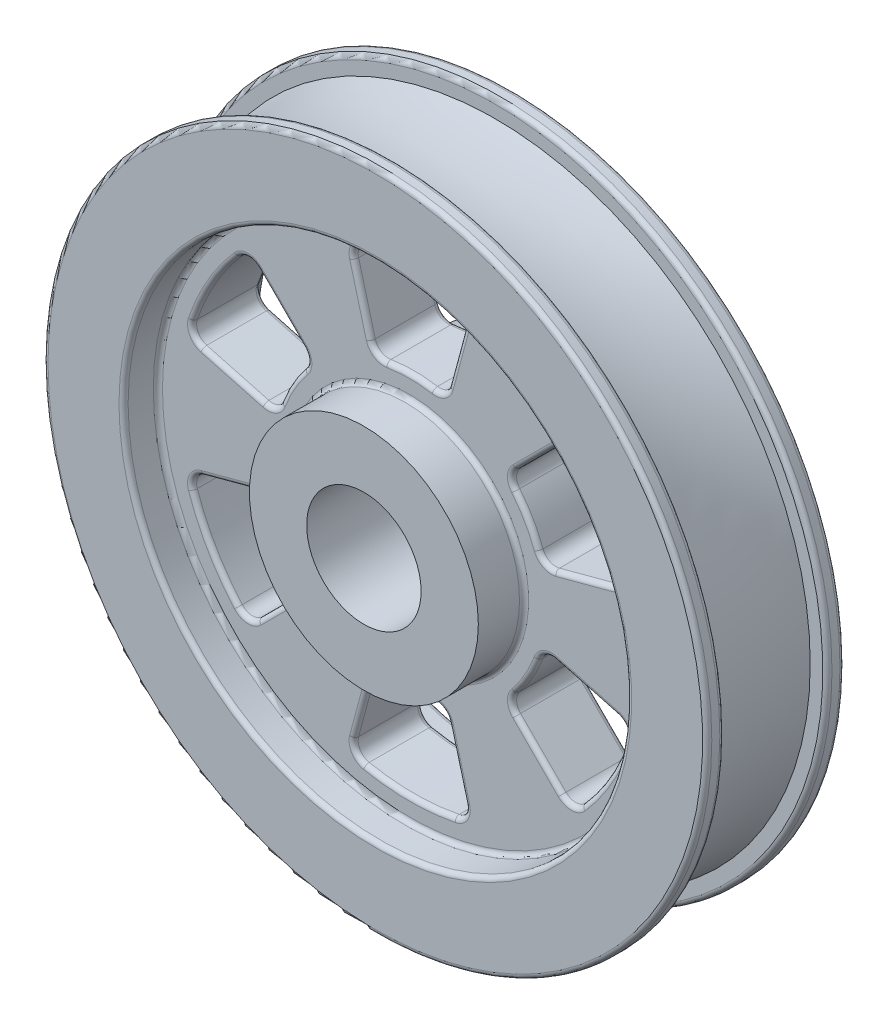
from build123d import *

# Parameters (mm, degrees)
SPOKE_HOLE_DEPTH             = 269.057260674
SPOKE_HOLE_PATTERN_COUNT     = 6
F_0_10_INCH_FILLETS_ROUNDS_R = 2.54


with BuildPart() as part:
    # Wheel Cross-section → Revolve1 (revolve)
    with BuildSketch(Plane(origin=(0, 0, 0), x_dir=(0, 0, -1), z_dir=(1, 0, 0)), mode=Mode.PRIVATE) as revolve1_sk:
        with BuildLine():
            Line((44.45, 31.75), (44.45, 63.5))
            Line((44.45, 63.5), (19.05, 63.5))
            Line((19.05, 63.5), (19.05, 139.7))
            Line((19.05, 139.7), (38.1, 139.7))
            Line((38.1, 139.7), (38.1, 184.15))
            Line((38.1, 184.15), (28.575, 184.15))
            Line((28.575, 184.15), (28.575, 174.625))
            ThreePointArc((28.575, 174.625), (0, 171.922125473), (-28.575, 174.625))
            Line((-28.575, 174.625), (-28.575, 184.15))
            Line((-28.575, 184.15), (-38.1, 184.15))
            Line((-38.1, 184.15), (-38.1, 139.7))
            Line((-38.1, 139.7), (-19.05, 139.7))
            Line((-19.05, 139.7), (-19.05, 63.5))
            Line((-19.05, 63.5), (-44.45, 63.5))
            Line((-44.45, 63.5), (-44.45, 31.75))
            Line((-44.45, 31.75), (44.45, 31.75))
        make_face()
    revolve(revolve1_sk.sketch.rotate(Axis((0, 0, 130.774722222), (0, 0, -1)), 90), axis=Axis((0, 0, 130.774722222), (0, 0, -1)))

    # Spoke cut-out → Spoke hole (cut, through all)
    with BuildSketch(Plane.XY.offset(19.05)):
        with BuildLine():
            Line((30.834810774, 115.077080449), (21.604380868, 80.628647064))
            ThreePointArc((21.604380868, 80.628647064), (18.350350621, 76.181930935), (12.94911461, 75.09168017))
            ThreePointArc((12.94911461, 75.09168017), (0, 76.2), (-12.94911461, 75.09168017))
            ThreePointArc((-12.94911461, 75.09168017), (-18.350350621, 76.181930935), (-21.604380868, 80.628647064))
            Line((-21.604380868, 80.628647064), (-30.834810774, 115.077080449))
            ThreePointArc((-30.834810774, 115.077080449), (-29.948546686, 121.068056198), (-24.972825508, 124.520512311))
            ThreePointArc((-24.972825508, 124.520512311), (0, 127), (24.972825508, 124.520512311))
            ThreePointArc((24.972825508, 124.520512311), (29.948546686, 121.068056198), (30.834810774, 115.077080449))
        make_face()
    spoke_hole = extrude(amount=-SPOKE_HOLE_DEPTH, mode=Mode.SUBTRACT)

    # Spoke hole pattern: Spoke hole ×6 about axis
    spoke_hole_pattern_axis = Axis((0, 0, 0), (0, 0, 1))
    for i in range(1, SPOKE_HOLE_PATTERN_COUNT):
        add(spoke_hole.rotate(spoke_hole_pattern_axis, i * 360 / SPOKE_HOLE_PATTERN_COUNT), mode=Mode.SUBTRACT)

    # 0.10 inch Fillets _ Rounds
    f_0_10_inch_fillets_rounds_edges = [part.edges().sort_by_distance(p)[0] for p in [
        (-184.15, 0, -38.1),
        (-119.822285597, -34.597825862, 19.05),
        (-109.985226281, -63.5, 19.05),
        (-89.873738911, -86.470230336, 19.05),
        (-71.633267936, -71.633267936, 19.05),
        (-56.800312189, -53.982835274, 19.05),
        (-65.991135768, -38.1, 19.05),
        (-75.15066281, -22.199095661, 19.05),
        (-97.852863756, -26.219595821, 19.05),
        (-184.15, 0, -28.575),
        (-184.15, 0, 28.575),
        (0, -127, -19.05),
        (29.948546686, -121.068056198, -19.05),
        (26.219595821, -97.852863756, -19.05),
        (18.350350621, -76.181930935, -19.05),
        (0, -76.2, -19.05),
        (-18.350350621, -76.181930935, -19.05),
        (-26.219595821, -97.852863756, -19.05),
        (-29.948546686, -121.068056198, -19.05),
        (-184.15, 0, 38.1),
        (-139.7, 0, 38.1),
        (-29.948546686, -121.068056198, 19.05),
        (0, -127, 19.05),
        (29.948546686, -121.068056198, 19.05),
        (26.219595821, -97.852863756, 19.05),
        (18.350350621, -76.181930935, 19.05),
        (0, -76.2, 19.05),
        (-18.350350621, -76.181930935, 19.05),
        (-26.219595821, -97.852863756, 19.05),
        (-139.7, 0, 19.05),
        (-63.5, 0, 19.05),
        (109.985226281, -63.5, -19.05),
        (119.822285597, -34.597825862, -19.05),
        (97.852863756, -26.219595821, -19.05),
        (75.15066281, -22.199095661, -19.05),
        (65.991135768, -38.1, -19.05),
        (56.800312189, -53.982835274, -19.05),
        (71.633267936, -71.633267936, -19.05),
        (89.873738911, -86.470230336, -19.05),
        (89.873738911, -86.470230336, 19.05),
        (109.985226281, -63.5, 19.05),
        (119.822285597, -34.597825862, 19.05),
        (97.852863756, -26.219595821, 19.05),
        (75.15066281, -22.199095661, 19.05),
        (65.991135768, -38.1, 19.05),
        (56.800312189, -53.982835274, 19.05),
        (71.633267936, -71.633267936, 19.05),
        (109.985226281, 63.5, -19.05),
        (89.873738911, 86.470230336, -19.05),
        (71.633267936, 71.633267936, -19.05),
        (56.800312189, 53.982835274, -19.05),
        (65.991135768, 38.1, -19.05),
        (75.15066281, 22.199095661, -19.05),
        (97.852863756, 26.219595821, -19.05),
        (119.822285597, 34.597825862, -19.05),
        (119.822285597, 34.597825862, 19.05),
        (109.985226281, 63.5, 19.05),
        (89.873738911, 86.470230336, 19.05),
        (71.633267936, 71.633267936, 19.05),
        (56.800312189, 53.982835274, 19.05),
        (65.991135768, 38.1, 19.05),
        (75.15066281, 22.199095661, 19.05),
        (97.852863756, 26.219595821, 19.05),
        (0, 127, -19.05),
        (-29.948546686, 121.068056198, -19.05),
        (-26.219595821, 97.852863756, -19.05),
        (-18.350350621, 76.181930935, -19.05),
        (0, 76.2, -19.05),
        (18.350350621, 76.181930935, -19.05),
        (26.219595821, 97.852863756, -19.05),
        (29.948546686, 121.068056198, -19.05),
        (29.948546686, 121.068056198, 19.05),
        (0, 127, 19.05),
        (-29.948546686, 121.068056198, 19.05),
        (-26.219595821, 97.852863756, 19.05),
        (-18.350350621, 76.181930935, 19.05),
        (0, 76.2, 19.05),
        (18.350350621, 76.181930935, 19.05),
        (26.219595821, 97.852863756, 19.05),
        (-109.985226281, 63.5, -19.05),
        (-119.822285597, 34.597825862, -19.05),
        (-97.852863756, 26.219595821, -19.05),
        (-75.15066281, 22.199095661, -19.05),
        (-65.991135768, 38.1, -19.05),
        (-56.800312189, 53.982835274, -19.05),
        (-71.633267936, 71.633267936, -19.05),
        (-89.873738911, 86.470230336, -19.05),
        (-89.873738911, 86.470230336, 19.05),
        (-109.985226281, 63.5, 19.05),
        (-119.822285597, 34.597825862, 19.05),
        (-97.852863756, 26.219595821, 19.05),
        (-75.15066281, 22.199095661, 19.05),
        (-65.991135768, 38.1, 19.05),
        (-56.800312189, 53.982835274, 19.05),
        (-71.633267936, 71.633267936, 19.05),
        (-63.5, 0, -19.05),
        (-139.7, 0, -19.05),
        (-109.985226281, -63.5, -19.05),
        (-89.873738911, -86.470230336, -19.05),
        (-71.633267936, -71.633267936, -19.05),
        (-56.800312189, -53.982835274, -19.05),
        (-65.991135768, -38.1, -19.05),
        (-75.15066281, -22.199095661, -19.05),
        (-97.852863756, -26.219595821, -19.05),
        (-119.822285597, -34.597825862, -19.05),
        (-139.7, 0, -38.1),
    ]]
    fillet(f_0_10_inch_fillets_rounds_edges, radius=F_0_10_INCH_FILLETS_ROUNDS_R)


solid = part.part
